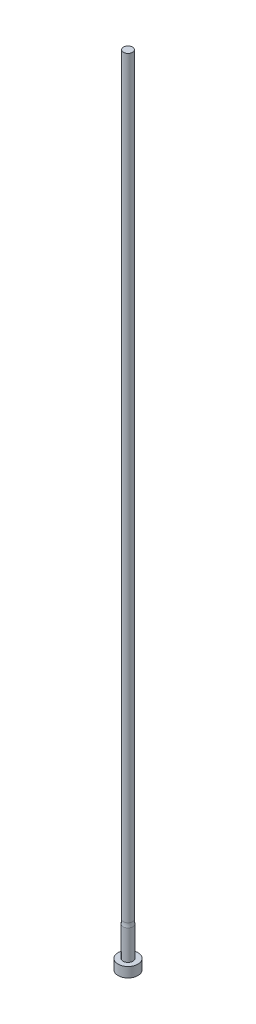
ISO-10303-21;
HEADER;
FILE_DESCRIPTION(('STEP AP214'),'2;1');
FILE_NAME('part.step','',(''),(''),'','','');
FILE_SCHEMA(('AUTOMOTIVE_DESIGN { 1 0 10303 214 1 1 1 1 }'));
ENDSEC;
DATA;
#1=APPLICATION_CONTEXT('core data for automotive mechanical design processes');
#2=APPLICATION_PROTOCOL_DEFINITION('international standard','automotive_design',2000,#1);
#3=PRODUCT_CONTEXT('',#1,'mechanical');
#4=PRODUCT('Part','Part','',(#3));
#5=PRODUCT_RELATED_PRODUCT_CATEGORY('part','',(#4));
#6=PRODUCT_DEFINITION_FORMATION('','',#4);
#7=PRODUCT_DEFINITION_CONTEXT('part definition',#1,'design');
#8=PRODUCT_DEFINITION('design','',#6,#7);
#9=PRODUCT_DEFINITION_SHAPE('','',#8);
#10=(LENGTH_UNIT() NAMED_UNIT(*) SI_UNIT(.MILLI.,.METRE.));
#11=(NAMED_UNIT(*) PLANE_ANGLE_UNIT() SI_UNIT($,.RADIAN.));
#12=(NAMED_UNIT(*) SI_UNIT($,.STERADIAN.) SOLID_ANGLE_UNIT());
#13=UNCERTAINTY_MEASURE_WITH_UNIT(LENGTH_MEASURE(1.E-05),#10,'distance_accuracy_value','');
#14=(GEOMETRIC_REPRESENTATION_CONTEXT(3) GLOBAL_UNCERTAINTY_ASSIGNED_CONTEXT((#13)) GLOBAL_UNIT_ASSIGNED_CONTEXT((#10,
#11,#12)) REPRESENTATION_CONTEXT('',''));
#15=CARTESIAN_POINT('',(0.,0.,0.));
#16=DIRECTION('',(0.,0.,1.));
#17=DIRECTION('',(1.,0.,0.));
#18=AXIS2_PLACEMENT_3D('',#15,#16,#17);
#19=CARTESIAN_POINT('',(0.,0.,0.));
#20=DIRECTION('',(0.,1.,0.));
#21=DIRECTION('',(-1.,0.,0.));
#22=AXIS2_PLACEMENT_3D('',#19,#20,#21);
#23=PLANE('',#22);
#24=CARTESIAN_POINT('',(0.,0.,0.));
#25=DIRECTION('',(0.,1.,0.));
#26=DIRECTION('',(-1.,0.,0.));
#27=AXIS2_PLACEMENT_3D('',#24,#25,#26);
#28=CIRCLE('',#27,3.175);
#29=CARTESIAN_POINT('',(-3.175,0.,0.));
#30=VERTEX_POINT('',#29);
#31=EDGE_CURVE('E37',#30,#30,#28,.T.);
#32=ORIENTED_EDGE('',*,*,#31,.F.);
#33=EDGE_LOOP('',(#32));
#34=FACE_BOUND('',#33,.T.);
#35=ADVANCED_FACE('F30',(#34),#23,.F.);
#36=CARTESIAN_POINT('',(0.,254.,0.));
#37=DIRECTION('',(0.,1.,0.));
#38=DIRECTION('',(-1.,0.,0.));
#39=AXIS2_PLACEMENT_3D('',#36,#37,#38);
#40=CYLINDRICAL_SURFACE('',#39,3.175);
#41=CARTESIAN_POINT('',(0.,3.17499999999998,0.));
#42=DIRECTION('',(0.,1.,0.));
#43=DIRECTION('',(-1.,0.,0.));
#44=AXIS2_PLACEMENT_3D('',#41,#42,#43);
#45=CIRCLE('',#44,3.175);
#46=CARTESIAN_POINT('',(-3.175,3.17499999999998,0.));
#47=VERTEX_POINT('',#46);
#48=EDGE_CURVE('E41',#47,#47,#45,.T.);
#49=ORIENTED_EDGE('',*,*,#48,.F.);
#50=EDGE_LOOP('',(#49));
#51=FACE_BOUND('',#50,.T.);
#52=ORIENTED_EDGE('',*,*,#31,.T.);
#53=EDGE_LOOP('',(#52));
#54=FACE_BOUND('',#53,.T.);
#55=ADVANCED_FACE('F72',(#51,#54),#40,.T.);
#56=CARTESIAN_POINT('',(3.175,3.175,0.));
#57=DIRECTION('',(0.,-1.,0.));
#58=DIRECTION('',(1.,0.,0.));
#59=AXIS2_PLACEMENT_3D('',#56,#57,#58);
#60=PLANE('',#59);
#61=CARTESIAN_POINT('',(0.,3.17499999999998,0.));
#62=DIRECTION('',(0.,1.,0.));
#63=DIRECTION('',(-1.,0.,0.));
#64=AXIS2_PLACEMENT_3D('',#61,#62,#63);
#65=CIRCLE('',#64,1.58750000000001);
#66=CARTESIAN_POINT('',(-1.58750000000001,3.17499999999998,0.));
#67=VERTEX_POINT('',#66);
#68=EDGE_CURVE('E45',#67,#67,#65,.T.);
#69=ORIENTED_EDGE('',*,*,#68,.F.);
#70=EDGE_LOOP('',(#69));
#71=FACE_BOUND('',#70,.T.);
#72=ORIENTED_EDGE('',*,*,#48,.T.);
#73=EDGE_LOOP('',(#72));
#74=FACE_BOUND('',#73,.T.);
#75=ADVANCED_FACE('F68',(#71,#74),#60,.F.);
#76=CARTESIAN_POINT('',(0.,254.,0.));
#77=DIRECTION('',(0.,1.,0.));
#78=DIRECTION('',(-1.,0.,0.));
#79=AXIS2_PLACEMENT_3D('',#76,#77,#78);
#80=CYLINDRICAL_SURFACE('',#79,1.58750000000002);
#81=CARTESIAN_POINT('',(0.,12.7,0.));
#82=DIRECTION('',(0.,1.,0.));
#83=DIRECTION('',(-1.,0.,0.));
#84=AXIS2_PLACEMENT_3D('',#81,#82,#83);
#85=CIRCLE('',#84,1.58750000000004);
#86=CARTESIAN_POINT('',(-1.58750000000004,12.7,0.));
#87=VERTEX_POINT('',#86);
#88=EDGE_CURVE('E50',#87,#87,#85,.T.);
#89=ORIENTED_EDGE('',*,*,#88,.F.);
#90=EDGE_LOOP('',(#89));
#91=FACE_BOUND('',#90,.T.);
#92=ORIENTED_EDGE('',*,*,#68,.T.);
#93=EDGE_LOOP('',(#92));
#94=FACE_BOUND('',#93,.T.);
#95=ADVANCED_FACE('F61',(#91,#94),#80,.T.);
#96=CARTESIAN_POINT('',(0.,254.,0.));
#97=DIRECTION('',(0.,1.,0.));
#98=DIRECTION('',(-1.,0.,0.));
#99=AXIS2_PLACEMENT_3D('',#96,#97,#98);
#100=CYLINDRICAL_SURFACE('',#99,1.45161000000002);
#101=CARTESIAN_POINT('',(0.,14.0066510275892,0.));
#102=DIRECTION('',(0.,-1.,0.));
#103=DIRECTION('',(1.,0.,0.));
#104=AXIS2_PLACEMENT_3D('',#101,#102,#103);
#105=CIRCLE('',#104,1.45161000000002);
#106=CARTESIAN_POINT('',(1.45161000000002,14.0066510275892,0.));
#107=VERTEX_POINT('',#106);
#108=EDGE_CURVE('E10',#107,#107,#105,.F.);
#109=ORIENTED_EDGE('',*,*,#108,.T.);
#110=EDGE_LOOP('',(#109));
#111=FACE_BOUND('',#110,.T.);
#112=CARTESIAN_POINT('',(0.,254.,0.));
#113=DIRECTION('',(0.,1.,0.));
#114=DIRECTION('',(-1.,0.,0.));
#115=AXIS2_PLACEMENT_3D('',#112,#113,#114);
#116=CIRCLE('',#115,1.45161000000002);
#117=CARTESIAN_POINT('',(-1.45161,254.,0.));
#118=VERTEX_POINT('',#117);
#119=EDGE_CURVE('E53',#118,#118,#116,.T.);
#120=ORIENTED_EDGE('',*,*,#119,.F.);
#121=EDGE_LOOP('',(#120));
#122=FACE_BOUND('',#121,.T.);
#123=ADVANCED_FACE('F59',(#111,#122),#100,.T.);
#124=CARTESIAN_POINT('',(1.45161000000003,254.,0.));
#125=DIRECTION('',(0.,-1.,0.));
#126=DIRECTION('',(1.,0.,0.));
#127=AXIS2_PLACEMENT_3D('',#124,#125,#126);
#128=PLANE('',#127);
#129=ORIENTED_EDGE('',*,*,#119,.T.);
#130=EDGE_LOOP('',(#129));
#131=FACE_BOUND('',#130,.T.);
#132=ADVANCED_FACE('F57',(#131),#128,.F.);
#133=CARTESIAN_POINT('',(0.,14.0066510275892,0.));
#134=DIRECTION('',(0.,-1.,0.));
#135=DIRECTION('',(1.,0.,0.));
#136=AXIS2_PLACEMENT_3D('',#133,#134,#135);
#137=TOROIDAL_SURFACE('',#136,7.80161000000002,6.35);
#138=ORIENTED_EDGE('',*,*,#88,.T.);
#139=EDGE_LOOP('',(#138));
#140=FACE_BOUND('',#139,.T.);
#141=ORIENTED_EDGE('',*,*,#108,.F.);
#142=EDGE_LOOP('',(#141));
#143=FACE_BOUND('',#142,.T.);
#144=ADVANCED_FACE('F32',(#140,#143),#137,.F.);
#145=CLOSED_SHELL('',(#35,#55,#75,#95,#123,#132,#144));
#146=MANIFOLD_SOLID_BREP('B2',#145);
#147=ADVANCED_BREP_SHAPE_REPRESENTATION('',(#18,#146),#14);
#148=SHAPE_DEFINITION_REPRESENTATION(#9,#147);
ENDSEC;
END-ISO-10303-21;
